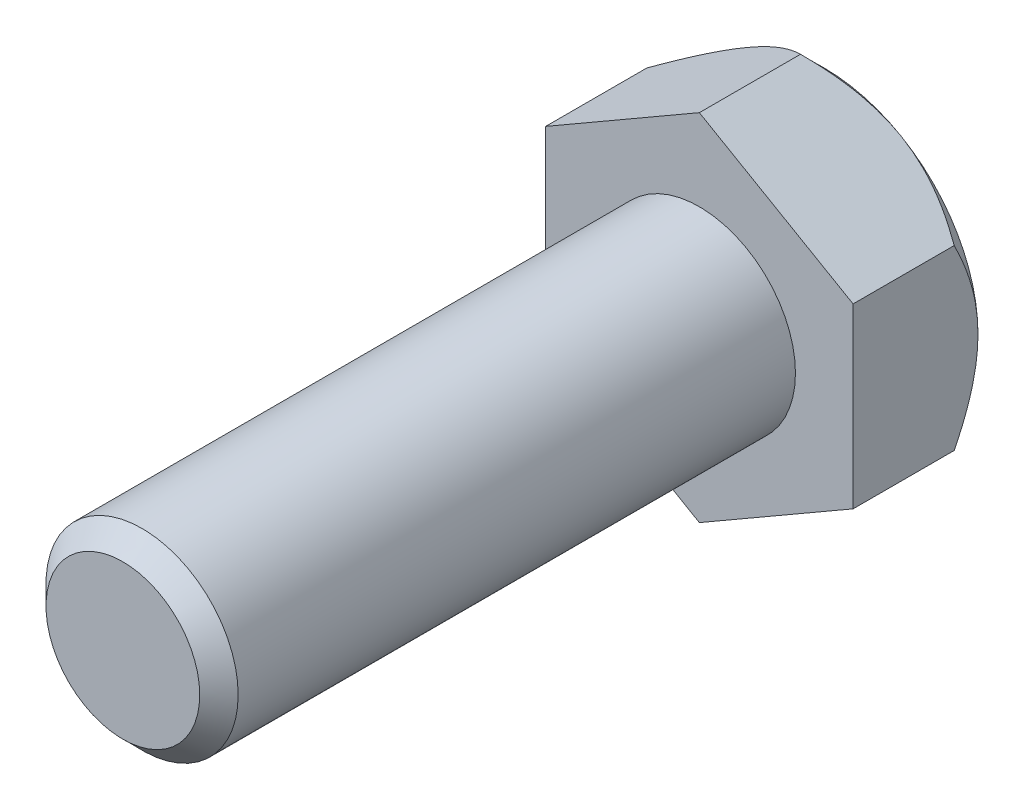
ISO-10303-21;
HEADER;
FILE_DESCRIPTION(('STEP AP214'),'2;1');
FILE_NAME('part.step','',(''),(''),'','','');
FILE_SCHEMA(('AUTOMOTIVE_DESIGN { 1 0 10303 214 1 1 1 1 }'));
ENDSEC;
DATA;
#1=APPLICATION_CONTEXT('core data for automotive mechanical design processes');
#2=APPLICATION_PROTOCOL_DEFINITION('international standard','automotive_design',2000,#1);
#3=PRODUCT_CONTEXT('',#1,'mechanical');
#4=PRODUCT('Part','Part','',(#3));
#5=PRODUCT_RELATED_PRODUCT_CATEGORY('part','',(#4));
#6=PRODUCT_DEFINITION_FORMATION('','',#4);
#7=PRODUCT_DEFINITION_CONTEXT('part definition',#1,'design');
#8=PRODUCT_DEFINITION('design','',#6,#7);
#9=PRODUCT_DEFINITION_SHAPE('','',#8);
#10=(LENGTH_UNIT() NAMED_UNIT(*) SI_UNIT(.MILLI.,.METRE.));
#11=(NAMED_UNIT(*) PLANE_ANGLE_UNIT() SI_UNIT($,.RADIAN.));
#12=(NAMED_UNIT(*) SI_UNIT($,.STERADIAN.) SOLID_ANGLE_UNIT());
#13=UNCERTAINTY_MEASURE_WITH_UNIT(LENGTH_MEASURE(1.E-05),#10,'distance_accuracy_value','');
#14=(GEOMETRIC_REPRESENTATION_CONTEXT(3) GLOBAL_UNCERTAINTY_ASSIGNED_CONTEXT((#13)) GLOBAL_UNIT_ASSIGNED_CONTEXT((#10,
#11,#12)) REPRESENTATION_CONTEXT('',''));
#15=CARTESIAN_POINT('',(0.,0.,0.));
#16=DIRECTION('',(0.,0.,1.));
#17=DIRECTION('',(1.,0.,0.));
#18=AXIS2_PLACEMENT_3D('',#15,#16,#17);
#19=CARTESIAN_POINT('',(16.,9.23760430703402,13.));
#20=DIRECTION('',(-0.5,-0.866025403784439,0.));
#21=DIRECTION('',(0.866025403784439,-0.5,0.));
#22=AXIS2_PLACEMENT_3D('',#19,#20,#21);
#23=PLANE('',#22);
#24=CARTESIAN_POINT('',(-0.000200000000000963,18.4753240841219,2.47532408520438));
#25=CARTESIAN_POINT('',(0.274873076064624,18.3165105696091,2.3165349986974));
#26=CARTESIAN_POINT('',(0.552100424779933,18.1564532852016,2.16259136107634));
#27=CARTESIAN_POINT('',(1.11119892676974,17.8336576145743,1.86593410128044));
#28=CARTESIAN_POINT('',(1.39307251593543,17.670917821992,1.7232266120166));
#29=CARTESIAN_POINT('',(1.96312819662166,17.3417960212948,1.4499764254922));
#30=CARTESIAN_POINT('',(2.25133716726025,17.1753984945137,1.31950805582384));
#31=CARTESIAN_POINT('',(2.83248894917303,16.8398703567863,1.07356977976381));
#32=CARTESIAN_POINT('',(3.12543102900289,16.6707401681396,0.95809758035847));
#33=CARTESIAN_POINT('',(3.71133791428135,16.332466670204,0.745804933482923));
#34=CARTESIAN_POINT('',(4.00423072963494,16.1633649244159,0.648721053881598));
#35=CARTESIAN_POINT('',(4.5941253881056,15.8227890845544,0.47296030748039));
#36=CARTESIAN_POINT('',(4.89112679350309,15.6513152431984,0.394281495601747));
#37=CARTESIAN_POINT('',(5.48795465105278,15.3067365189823,0.257308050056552));
#38=CARTESIAN_POINT('',(5.78777315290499,15.1336362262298,0.198967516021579));
#39=CARTESIAN_POINT('',(6.38996475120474,14.7859607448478,0.10396707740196));
#40=CARTESIAN_POINT('',(6.69233745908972,14.6113857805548,0.0673039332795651));
#41=CARTESIAN_POINT('',(7.21228047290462,14.3111965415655,0.0238844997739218));
#42=CARTESIAN_POINT('',(7.42951394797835,14.1857767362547,0.0115883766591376));
#43=CARTESIAN_POINT('',(7.86423667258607,13.9347894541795,-0.00119864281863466));
#44=CARTESIAN_POINT('',(8.08172590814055,13.8092219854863,-0.00169015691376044));
#45=CARTESIAN_POINT('',(8.51656302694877,13.5581686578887,0.00914657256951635));
#46=CARTESIAN_POINT('',(8.73391083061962,13.4326828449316,0.0204790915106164));
#47=CARTESIAN_POINT('',(9.16790379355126,13.1821168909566,0.0547844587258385));
#48=CARTESIAN_POINT('',(9.38454894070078,13.0570367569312,0.0777575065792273));
#49=CARTESIAN_POINT('',(10.033228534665,12.6825214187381,0.163733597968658));
#50=CARTESIAN_POINT('',(10.4636398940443,12.4340233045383,0.243783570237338));
#51=CARTESIAN_POINT('',(11.3169944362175,11.9413388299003,0.444965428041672));
#52=CARTESIAN_POINT('',(11.7399381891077,11.6971521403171,0.566094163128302));
#53=CARTESIAN_POINT('',(12.4907260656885,11.2636845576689,0.815279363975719));
#54=CARTESIAN_POINT('',(12.8202294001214,11.0734457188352,0.936780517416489));
#55=CARTESIAN_POINT('',(13.4733181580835,10.696384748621,1.19936105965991));
#56=CARTESIAN_POINT('',(13.7969034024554,10.5095627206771,1.34044104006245));
#57=CARTESIAN_POINT('',(14.4371411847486,10.1399212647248,1.6390166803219));
#58=CARTESIAN_POINT('',(14.7538119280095,9.95709132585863,1.79646071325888));
#59=CARTESIAN_POINT('',(15.3812901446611,9.59481660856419,2.12569791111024));
#60=CARTESIAN_POINT('',(15.692101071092,9.41536983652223,2.29748227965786));
#61=CARTESIAN_POINT('',(16.0002,9.23748883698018,2.47532408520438));
#62=B_SPLINE_CURVE_WITH_KNOTS('',3,(#24,#25,#26,#27,#28,#29,#30,#31,#32,#33,#34,#35,#36,#37,#38,
#39,#40,#41,#42,#43,#44,#45,#46,#47,#48,#49,#50,#51,#52,#53,#54,#55,#56,#57,#58,#59,#60,#61),
.UNSPECIFIED.,.F.,.F.,(4,2,2,2,2,2,2,2,2,2,2,2,2,2,2,2,2,2,4),(0.,1.06536581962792,
2.13130916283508,3.20335555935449,4.27523783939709,5.33035842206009,6.38536744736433,
7.43797982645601,8.49043486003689,9.2435992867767,9.99672430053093,10.7501217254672,
11.5035320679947,13.0116203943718,14.5195930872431,15.7172424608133,16.9149280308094,
18.108943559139,19.3022319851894),.UNSPECIFIED.);
#63=CARTESIAN_POINT('',(0.,18.475208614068,2.47520861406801));
#64=VERTEX_POINT('',#63);
#65=CARTESIAN_POINT('',(8.,13.856406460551,0.));
#66=VERTEX_POINT('',#65);
#67=EDGE_CURVE('E51',#64,#66,#62,.T.);
#68=ORIENTED_EDGE('',*,*,#67,.F.);
#69=DIRECTION('',(0.,0.,-1.));
#70=VECTOR('',#69,1.);
#71=CARTESIAN_POINT('',(0.,18.475208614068,13.));
#72=LINE('',#71,#70);
#73=CARTESIAN_POINT('',(0.,18.475208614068,13.));
#74=VERTEX_POINT('',#73);
#75=EDGE_CURVE('E148',#74,#64,#72,.T.);
#76=ORIENTED_EDGE('',*,*,#75,.F.);
#77=DIRECTION('',(-0.866025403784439,0.5,0.));
#78=VECTOR('',#77,1.);
#79=CARTESIAN_POINT('',(16.,9.23760430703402,13.));
#80=LINE('',#79,#78);
#81=CARTESIAN_POINT('',(16.,9.23760430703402,13.));
#82=VERTEX_POINT('',#81);
#83=EDGE_CURVE('E249',#82,#74,#80,.T.);
#84=ORIENTED_EDGE('',*,*,#83,.F.);
#85=DIRECTION('',(0.,0.,-1.));
#86=VECTOR('',#85,1.);
#87=CARTESIAN_POINT('',(16.,9.23760430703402,13.));
#88=LINE('',#87,#86);
#89=CARTESIAN_POINT('',(16.,9.23760430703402,2.47520861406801));
#90=VERTEX_POINT('',#89);
#91=EDGE_CURVE('E135',#82,#90,#88,.T.);
#92=ORIENTED_EDGE('',*,*,#91,.T.);
#93=EDGE_CURVE('E129',#66,#90,#62,.T.);
#94=ORIENTED_EDGE('',*,*,#93,.F.);
#95=EDGE_LOOP('',(#68,#76,#84,#92,#94));
#96=FACE_BOUND('',#95,.T.);
#97=ADVANCED_FACE('F35',(#96),#23,.F.);
#98=CARTESIAN_POINT('',(0.,18.475208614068,13.));
#99=DIRECTION('',(0.5,-0.866025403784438,0.));
#100=DIRECTION('',(0.866025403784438,0.5,0.));
#101=AXIS2_PLACEMENT_3D('',#98,#99,#100);
#102=PLANE('',#101);
#103=CARTESIAN_POINT('',(-16.0002,9.23748883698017,2.47532408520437));
#104=CARTESIAN_POINT('',(-15.7251269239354,9.39630235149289,2.31653499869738));
#105=CARTESIAN_POINT('',(-15.4478995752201,9.5563596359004,2.16259136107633));
#106=CARTESIAN_POINT('',(-14.8888010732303,9.87915530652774,1.86593410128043));
#107=CARTESIAN_POINT('',(-14.6069274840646,10.04189509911,1.72322661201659));
#108=CARTESIAN_POINT('',(-14.0368718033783,10.3710168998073,1.44997642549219));
#109=CARTESIAN_POINT('',(-13.7486628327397,10.5374144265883,1.31950805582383));
#110=CARTESIAN_POINT('',(-13.167511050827,10.8729425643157,1.0735697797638));
#111=CARTESIAN_POINT('',(-12.8745689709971,11.0420727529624,0.958097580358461));
#112=CARTESIAN_POINT('',(-12.2886620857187,11.380346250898,0.745804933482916));
#113=CARTESIAN_POINT('',(-11.9957692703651,11.5494479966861,0.64872105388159));
#114=CARTESIAN_POINT('',(-11.4058746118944,11.8900238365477,0.472960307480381));
#115=CARTESIAN_POINT('',(-11.1088732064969,12.0614976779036,0.394281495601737));
#116=CARTESIAN_POINT('',(-10.5120453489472,12.4060764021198,0.257308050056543));
#117=CARTESIAN_POINT('',(-10.212226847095,12.5791766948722,0.198967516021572));
#118=CARTESIAN_POINT('',(-9.61003524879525,12.9268521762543,0.103967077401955));
#119=CARTESIAN_POINT('',(-9.30766254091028,13.1014271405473,0.0673039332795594));
#120=CARTESIAN_POINT('',(-8.78771952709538,13.4016163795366,0.0238844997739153));
#121=CARTESIAN_POINT('',(-8.57048605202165,13.5270361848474,0.0115883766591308));
#122=CARTESIAN_POINT('',(-8.13576332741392,13.7780234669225,-0.00119864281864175));
#123=CARTESIAN_POINT('',(-7.91827409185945,13.9035909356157,-0.00169015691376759));
#124=CARTESIAN_POINT('',(-7.48343697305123,14.1546442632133,0.00914657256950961));
#125=CARTESIAN_POINT('',(-7.26608916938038,14.2801300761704,0.0204790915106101));
#126=CARTESIAN_POINT('',(-6.83209620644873,14.5306960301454,0.0547844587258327));
#127=CARTESIAN_POINT('',(-6.61545105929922,14.6557761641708,0.0777575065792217));
#128=CARTESIAN_POINT('',(-5.96677146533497,15.0302915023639,0.163733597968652));
#129=CARTESIAN_POINT('',(-5.53636010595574,15.2787896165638,0.243783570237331));
#130=CARTESIAN_POINT('',(-4.68300556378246,15.7714740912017,0.444965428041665));
#131=CARTESIAN_POINT('',(-4.26006181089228,16.0156607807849,0.566094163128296));
#132=CARTESIAN_POINT('',(-3.50927393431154,16.4491283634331,0.815279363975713));
#133=CARTESIAN_POINT('',(-3.17977059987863,16.6393672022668,0.936780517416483));
#134=CARTESIAN_POINT('',(-2.52668184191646,17.016428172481,1.19936105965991));
#135=CARTESIAN_POINT('',(-2.20309659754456,17.2032502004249,1.34044104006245));
#136=CARTESIAN_POINT('',(-1.56285881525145,17.5728916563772,1.6390166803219));
#137=CARTESIAN_POINT('',(-1.24618807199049,17.7557215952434,1.79646071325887));
#138=CARTESIAN_POINT('',(-0.618709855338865,18.1179963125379,2.12569791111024));
#139=CARTESIAN_POINT('',(-0.307898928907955,18.2974430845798,2.29748227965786));
#140=CARTESIAN_POINT('',(0.000200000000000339,18.4753240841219,2.47532408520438));
#141=B_SPLINE_CURVE_WITH_KNOTS('',3,(#103,#104,#105,#106,#107,#108,#109,#110,#111,#112,#113,
#114,#115,#116,#117,#118,#119,#120,#121,#122,#123,#124,#125,#126,#127,#128,#129,#130,#131,#132,
#133,#134,#135,#136,#137,#138,#139,#140),.UNSPECIFIED.,.F.,.F.,(4,2,2,2,2,2,2,2,2,2,2,2,2,2,2,2,
2,2,4),(0.,1.06536581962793,2.13130916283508,3.2033555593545,4.27523783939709,5.3303584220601,
6.38536744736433,7.43797982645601,8.4904348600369,9.24359928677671,9.99672430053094,
10.7501217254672,11.5035320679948,13.0116203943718,14.5195930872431,15.7172424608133,
16.9149280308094,18.108943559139,19.3022319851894),.UNSPECIFIED.);
#142=CARTESIAN_POINT('',(-16.,9.23760430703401,2.47520861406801));
#143=VERTEX_POINT('',#142);
#144=CARTESIAN_POINT('',(-8.00000000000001,13.856406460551,0.));
#145=VERTEX_POINT('',#144);
#146=EDGE_CURVE('E58',#143,#145,#141,.T.);
#147=ORIENTED_EDGE('',*,*,#146,.F.);
#148=DIRECTION('',(0.,0.,-1.));
#149=VECTOR('',#148,1.);
#150=CARTESIAN_POINT('',(-16.,9.23760430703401,13.));
#151=LINE('',#150,#149);
#152=CARTESIAN_POINT('',(-16.,9.23760430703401,13.));
#153=VERTEX_POINT('',#152);
#154=EDGE_CURVE('E145',#153,#143,#151,.T.);
#155=ORIENTED_EDGE('',*,*,#154,.F.);
#156=DIRECTION('',(-0.866025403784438,-0.5,0.));
#157=VECTOR('',#156,1.);
#158=CARTESIAN_POINT('',(0.,18.475208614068,13.));
#159=LINE('',#158,#157);
#160=EDGE_CURVE('E247',#74,#153,#159,.T.);
#161=ORIENTED_EDGE('',*,*,#160,.F.);
#162=ORIENTED_EDGE('',*,*,#75,.T.);
#163=EDGE_CURVE('E169',#145,#64,#141,.T.);
#164=ORIENTED_EDGE('',*,*,#163,.F.);
#165=EDGE_LOOP('',(#147,#155,#161,#162,#164));
#166=FACE_BOUND('',#165,.T.);
#167=ADVANCED_FACE('F176',(#166),#102,.F.);
#168=CARTESIAN_POINT('',(-16.,9.23760430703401,13.));
#169=DIRECTION('',(1.,0.,0.));
#170=DIRECTION('',(0.,1.,0.));
#171=AXIS2_PLACEMENT_3D('',#168,#169,#170);
#172=PLANE('',#171);
#173=CARTESIAN_POINT('',(-16.,-20.9426996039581,10.3552018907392));
#174=CARTESIAN_POINT('',(-16.,-20.6926064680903,10.1564729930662));
#175=CARTESIAN_POINT('',(-16.,-20.4418779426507,9.9585442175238));
#176=CARTESIAN_POINT('',(-16.,-19.9390378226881,9.56444441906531));
#177=CARTESIAN_POINT('',(-16.,-19.686926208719,9.36827342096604));
#178=CARTESIAN_POINT('',(-16.,-18.9282584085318,8.78256415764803));
#179=CARTESIAN_POINT('',(-16.,-18.4194685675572,8.39590872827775));
#180=CARTESIAN_POINT('',(-16.,-17.3910449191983,7.62901052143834));
#181=CARTESIAN_POINT('',(-16.,-16.8713581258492,7.24883865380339));
#182=CARTESIAN_POINT('',(-16.,-15.8237057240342,6.50011980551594));
#183=CARTESIAN_POINT('',(-16.,-15.2957406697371,6.13157205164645));
#184=CARTESIAN_POINT('',(-16.,-14.1895322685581,5.38141922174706));
#185=CARTESIAN_POINT('',(-16.,-13.6105159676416,5.00094861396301));
#186=CARTESIAN_POINT('',(-16.,-12.4388329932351,4.2612445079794));
#187=CARTESIAN_POINT('',(-16.,-11.8461638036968,3.90201496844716));
#188=CARTESIAN_POINT('',(-16.,-10.6466339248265,3.21225286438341));
#189=CARTESIAN_POINT('',(-16.,-10.0398214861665,2.88163693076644));
#190=CARTESIAN_POINT('',(-16.,-8.80796271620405,2.25646976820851));
#191=CARTESIAN_POINT('',(-16.,-8.18292578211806,1.96190034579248));
#192=CARTESIAN_POINT('',(-16.,-7.27098762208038,1.57284203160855));
#193=CARTESIAN_POINT('',(-16.,-6.99222005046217,1.4592164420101));
#194=CARTESIAN_POINT('',(-16.,-6.43080908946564,1.24204738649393));
#195=CARTESIAN_POINT('',(-16.,-6.1481657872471,1.13850369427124));
#196=CARTESIAN_POINT('',(-16.,-5.29426133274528,0.844699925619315));
#197=CARTESIAN_POINT('',(-16.,-4.71697423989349,0.671244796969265));
#198=CARTESIAN_POINT('',(-16.,-3.84719074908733,0.453698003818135));
#199=CARTESIAN_POINT('',(-16.,-3.55979484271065,0.388776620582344));
#200=CARTESIAN_POINT('',(-16.,-2.98218355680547,0.273089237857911));
#201=CARTESIAN_POINT('',(-16.,-2.69196868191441,0.222320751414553));
#202=CARTESIAN_POINT('',(-16.,-2.10933343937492,0.135869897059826));
#203=CARTESIAN_POINT('',(-16.,-1.81691336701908,0.100185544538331));
#204=CARTESIAN_POINT('',(-16.,-1.23057114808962,0.0445988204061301));
#205=CARTESIAN_POINT('',(-16.,-0.936649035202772,0.0246960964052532));
#206=CARTESIAN_POINT('',(-16.,-0.365997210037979,0.00180185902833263));
#207=CARTESIAN_POINT('',(-16.,-0.0893054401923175,-0.0021417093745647));
#208=CARTESIAN_POINT('',(-16.,0.463906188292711,0.00433422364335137));
#209=CARTESIAN_POINT('',(-16.,0.740426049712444,0.0147534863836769));
#210=CARTESIAN_POINT('',(-16.,1.29257694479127,0.0497611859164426));
#211=CARTESIAN_POINT('',(-16.,1.56820793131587,0.0743503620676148));
#212=CARTESIAN_POINT('',(-16.,2.11789448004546,0.137252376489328));
#213=CARTESIAN_POINT('',(-16.,2.3919500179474,0.175565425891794));
#214=CARTESIAN_POINT('',(-16.,2.94316448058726,0.26612719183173));
#215=CARTESIAN_POINT('',(-16.,3.22028154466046,0.318630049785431));
#216=CARTESIAN_POINT('',(-16.,3.7718139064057,0.436360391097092));
#217=CARTESIAN_POINT('',(-16.,4.04622881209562,0.501589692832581));
#218=CARTESIAN_POINT('',(-16.,4.86473786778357,0.714915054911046));
#219=CARTESIAN_POINT('',(-16.,5.40428452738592,0.880680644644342));
#220=CARTESIAN_POINT('',(-16.,6.47192398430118,1.25206491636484));
#221=CARTESIAN_POINT('',(-16.,6.99995405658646,1.45786018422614));
#222=CARTESIAN_POINT('',(-16.,8.04256648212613,1.90140202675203));
#223=CARTESIAN_POINT('',(-16.,8.55714291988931,2.13916238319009));
#224=CARTESIAN_POINT('',(-16.,9.57515450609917,2.64099813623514));
#225=CARTESIAN_POINT('',(-16.,10.0785505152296,2.90515222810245));
#226=CARTESIAN_POINT('',(-16.,11.0738527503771,3.45399484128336));
#227=CARTESIAN_POINT('',(-16.,11.5657606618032,3.7386803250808));
#228=CARTESIAN_POINT('',(-16.,12.5155261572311,4.3101398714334));
#229=CARTESIAN_POINT('',(-16.,12.9738658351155,4.59611693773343));
#230=CARTESIAN_POINT('',(-16.,13.8826699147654,5.18035386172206));
#231=CARTESIAN_POINT('',(-16.,14.3331337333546,5.4786146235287));
#232=CARTESIAN_POINT('',(-16.,15.2236360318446,6.08286643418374));
#233=CARTESIAN_POINT('',(-16.,15.6637287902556,6.3887776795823));
#234=CARTESIAN_POINT('',(-16.,16.3193680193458,6.85384205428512));
#235=CARTESIAN_POINT('',(-16.,16.5371369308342,7.00987611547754));
#236=CARTESIAN_POINT('',(-16.,16.9712874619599,7.32385355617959));
#237=CARTESIAN_POINT('',(-16.,17.1876691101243,7.48179689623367));
#238=CARTESIAN_POINT('',(-16.,17.4034082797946,7.6406137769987));
#239=B_SPLINE_CURVE_WITH_KNOTS('',3,(#173,#174,#175,#176,#177,#178,#179,#180,#181,#182,#183,
#184,#185,#186,#187,#188,#189,#190,#191,#192,#193,#194,#195,#196,#197,#198,#199,#200,#201,#202,
#203,#204,#205,#206,#207,#208,#209,#210,#211,#212,#213,#214,#215,#216,#217,#218,#219,#220,#221,
#222,#223,#224,#225,#226,#227,#228,#229,#230,#231,#232,#233,#234,#235,#236,#237,#238),
.UNSPECIFIED.,.F.,.F.,(4,2,2,2,2,2,2,2,2,2,2,2,2,2,2,2,2,2,2,2,2,2,2,2,2,2,2,2,2,2,2,2,4),(0.,
0.958306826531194,1.9166271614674,3.83364867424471,5.76521465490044,7.69665187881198,
9.77479256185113,11.8533193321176,13.9255704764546,15.9967713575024,16.8996995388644,
17.8026074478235,19.6082555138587,20.4918878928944,21.3753649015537,22.2587256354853,
23.1420666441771,23.9718573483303,24.8016342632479,25.6314544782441,26.4612874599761,
27.3070998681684,28.1530332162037,29.8443293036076,31.5432628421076,33.2429312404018,
34.9478278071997,36.652472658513,38.2729596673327,39.893566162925,41.5013542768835,
42.305043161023,43.1087154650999),.UNSPECIFIED.);
#240=CARTESIAN_POINT('',(-16.,-9.23760430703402,2.47520861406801));
#241=VERTEX_POINT('',#240);
#242=CARTESIAN_POINT('',(-16.,0.,0.));
#243=VERTEX_POINT('',#242);
#244=EDGE_CURVE('E251',#241,#243,#239,.T.);
#245=ORIENTED_EDGE('',*,*,#244,.F.);
#246=DIRECTION('',(0.,0.,-1.));
#247=VECTOR('',#246,1.);
#248=CARTESIAN_POINT('',(-16.,-9.23760430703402,13.));
#249=LINE('',#248,#247);
#250=CARTESIAN_POINT('',(-16.,-9.23760430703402,13.));
#251=VERTEX_POINT('',#250);
#252=EDGE_CURVE('E137',#251,#241,#249,.T.);
#253=ORIENTED_EDGE('',*,*,#252,.F.);
#254=DIRECTION('',(0.,-1.,0.));
#255=VECTOR('',#254,1.);
#256=CARTESIAN_POINT('',(-16.,9.23760430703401,13.));
#257=LINE('',#256,#255);
#258=EDGE_CURVE('E243',#153,#251,#257,.T.);
#259=ORIENTED_EDGE('',*,*,#258,.F.);
#260=ORIENTED_EDGE('',*,*,#154,.T.);
#261=EDGE_CURVE('E194',#243,#143,#239,.T.);
#262=ORIENTED_EDGE('',*,*,#261,.F.);
#263=EDGE_LOOP('',(#245,#253,#259,#260,#262));
#264=FACE_BOUND('',#263,.T.);
#265=ADVANCED_FACE('F231',(#264),#172,.F.);
#266=CARTESIAN_POINT('',(-16.,-9.23760430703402,13.));
#267=DIRECTION('',(0.5,0.866025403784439,0.));
#268=DIRECTION('',(-0.866025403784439,0.5,0.));
#269=AXIS2_PLACEMENT_3D('',#266,#267,#268);
#270=PLANE('',#269);
#271=CARTESIAN_POINT('',(0.000200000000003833,-18.4753240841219,2.47532408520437));
#272=CARTESIAN_POINT('',(-0.274873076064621,-18.3165105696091,2.31653499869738));
#273=CARTESIAN_POINT('',(-0.55210042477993,-18.1564532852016,2.16259136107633));
#274=CARTESIAN_POINT('',(-1.11119892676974,-17.8336576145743,1.86593410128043));
#275=CARTESIAN_POINT('',(-1.39307251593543,-17.670917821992,1.72322661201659));
#276=CARTESIAN_POINT('',(-1.96312819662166,-17.3417960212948,1.44997642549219));
#277=CARTESIAN_POINT('',(-2.25133716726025,-17.1753984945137,1.31950805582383));
#278=CARTESIAN_POINT('',(-2.83248894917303,-16.8398703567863,1.0735697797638));
#279=CARTESIAN_POINT('',(-3.12543102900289,-16.6707401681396,0.958097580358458));
#280=CARTESIAN_POINT('',(-3.71133791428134,-16.332466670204,0.745804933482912));
#281=CARTESIAN_POINT('',(-4.00423072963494,-16.1633649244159,0.648721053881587));
#282=CARTESIAN_POINT('',(-4.5941253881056,-15.8227890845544,0.47296030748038));
#283=CARTESIAN_POINT('',(-4.89112679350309,-15.6513152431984,0.394281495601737));
#284=CARTESIAN_POINT('',(-5.48795465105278,-15.3067365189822,0.257308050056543));
#285=CARTESIAN_POINT('',(-5.78777315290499,-15.1336362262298,0.19896751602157));
#286=CARTESIAN_POINT('',(-6.38996475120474,-14.7859607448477,0.103967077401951));
#287=CARTESIAN_POINT('',(-6.69233745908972,-14.6113857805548,0.0673039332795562));
#288=CARTESIAN_POINT('',(-7.21228047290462,-14.3111965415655,0.0238844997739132));
#289=CARTESIAN_POINT('',(-7.42951394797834,-14.1857767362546,0.0115883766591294));
#290=CARTESIAN_POINT('',(-7.86423667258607,-13.9347894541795,-0.00119864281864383));
#291=CARTESIAN_POINT('',(-8.08172590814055,-13.8092219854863,-0.00169015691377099));
#292=CARTESIAN_POINT('',(-8.51656302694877,-13.5581686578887,0.0091465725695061));
#293=CARTESIAN_POINT('',(-8.73391083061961,-13.4326828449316,0.0204790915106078));
#294=CARTESIAN_POINT('',(-9.16790379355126,-13.1821168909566,0.0547844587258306));
#295=CARTESIAN_POINT('',(-9.38454894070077,-13.0570367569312,0.0777575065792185));
#296=CARTESIAN_POINT('',(-10.033228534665,-12.6825214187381,0.163733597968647));
#297=CARTESIAN_POINT('',(-10.4636398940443,-12.4340233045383,0.243783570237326));
#298=CARTESIAN_POINT('',(-11.3169944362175,-11.9413388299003,0.444965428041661));
#299=CARTESIAN_POINT('',(-11.7399381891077,-11.6971521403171,0.566094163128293));
#300=CARTESIAN_POINT('',(-12.4907260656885,-11.2636845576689,0.815279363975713));
#301=CARTESIAN_POINT('',(-12.8202294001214,-11.0734457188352,0.936780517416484));
#302=CARTESIAN_POINT('',(-13.4733181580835,-10.696384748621,1.19936105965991));
#303=CARTESIAN_POINT('',(-13.7969034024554,-10.5095627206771,1.34044104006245));
#304=CARTESIAN_POINT('',(-14.4371411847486,-10.1399212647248,1.6390166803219));
#305=CARTESIAN_POINT('',(-14.7538119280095,-9.95709132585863,1.79646071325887));
#306=CARTESIAN_POINT('',(-15.3812901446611,-9.59481660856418,2.12569791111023));
#307=CARTESIAN_POINT('',(-15.692101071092,-9.41536983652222,2.29748227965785));
#308=CARTESIAN_POINT('',(-16.0002,-9.23748883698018,2.47532408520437));
#309=B_SPLINE_CURVE_WITH_KNOTS('',3,(#271,#272,#273,#274,#275,#276,#277,#278,#279,#280,#281,
#282,#283,#284,#285,#286,#287,#288,#289,#290,#291,#292,#293,#294,#295,#296,#297,#298,#299,#300,
#301,#302,#303,#304,#305,#306,#307,#308),.UNSPECIFIED.,.F.,.F.,(4,2,2,2,2,2,2,2,2,2,2,2,2,2,2,2,
2,2,4),(0.,1.06536581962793,2.13130916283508,3.2033555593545,4.27523783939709,5.3303584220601,
6.38536744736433,7.43797982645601,8.49043486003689,9.2435992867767,9.99672430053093,
10.7501217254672,11.5035320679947,13.0116203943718,14.5195930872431,15.7172424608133,
16.9149280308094,18.108943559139,19.3022319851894),.UNSPECIFIED.);
#310=CARTESIAN_POINT('',(0.,-18.475208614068,2.47520861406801));
#311=VERTEX_POINT('',#310);
#312=CARTESIAN_POINT('',(-8.,-13.856406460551,0.));
#313=VERTEX_POINT('',#312);
#314=EDGE_CURVE('E179',#311,#313,#309,.T.);
#315=ORIENTED_EDGE('',*,*,#314,.F.);
#316=DIRECTION('',(0.,0.,-1.));
#317=VECTOR('',#316,1.);
#318=CARTESIAN_POINT('',(0.,-18.475208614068,13.));
#319=LINE('',#318,#317);
#320=CARTESIAN_POINT('',(0.,-18.475208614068,13.));
#321=VERTEX_POINT('',#320);
#322=EDGE_CURVE('E134',#321,#311,#319,.T.);
#323=ORIENTED_EDGE('',*,*,#322,.F.);
#324=DIRECTION('',(0.866025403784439,-0.5,0.));
#325=VECTOR('',#324,1.);
#326=CARTESIAN_POINT('',(-16.,-9.23760430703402,13.));
#327=LINE('',#326,#325);
#328=EDGE_CURVE('E241',#251,#321,#327,.T.);
#329=ORIENTED_EDGE('',*,*,#328,.F.);
#330=ORIENTED_EDGE('',*,*,#252,.T.);
#331=EDGE_CURVE('E181',#313,#241,#309,.T.);
#332=ORIENTED_EDGE('',*,*,#331,.F.);
#333=EDGE_LOOP('',(#315,#323,#329,#330,#332));
#334=FACE_BOUND('',#333,.T.);
#335=ADVANCED_FACE('F237',(#334),#270,.F.);
#336=CARTESIAN_POINT('',(0.,-18.475208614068,13.));
#337=DIRECTION('',(-0.5,0.866025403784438,0.));
#338=DIRECTION('',(-0.866025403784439,-0.5,0.));
#339=AXIS2_PLACEMENT_3D('',#336,#337,#338);
#340=PLANE('',#339);
#341=CARTESIAN_POINT('',(16.0002,-9.23748883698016,2.47532408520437));
#342=CARTESIAN_POINT('',(15.7251269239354,-9.39630235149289,2.31653499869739));
#343=CARTESIAN_POINT('',(15.4478995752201,-9.5563596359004,2.16259136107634));
#344=CARTESIAN_POINT('',(14.8888010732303,-9.87915530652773,1.86593410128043));
#345=CARTESIAN_POINT('',(14.6069274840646,-10.04189509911,1.7232266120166));
#346=CARTESIAN_POINT('',(14.0368718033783,-10.3710168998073,1.44997642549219));
#347=CARTESIAN_POINT('',(13.7486628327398,-10.5374144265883,1.31950805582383));
#348=CARTESIAN_POINT('',(13.167511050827,-10.8729425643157,1.0735697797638));
#349=CARTESIAN_POINT('',(12.8745689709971,-11.0420727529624,0.958097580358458));
#350=CARTESIAN_POINT('',(12.2886620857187,-11.380346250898,0.745804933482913));
#351=CARTESIAN_POINT('',(11.9957692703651,-11.5494479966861,0.648721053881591));
#352=CARTESIAN_POINT('',(11.4058746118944,-11.8900238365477,0.472960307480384));
#353=CARTESIAN_POINT('',(11.1088732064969,-12.0614976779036,0.394281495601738));
#354=CARTESIAN_POINT('',(10.5120453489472,-12.4060764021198,0.25730805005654));
#355=CARTESIAN_POINT('',(10.212226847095,-12.5791766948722,0.198967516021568));
#356=CARTESIAN_POINT('',(9.61003524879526,-12.9268521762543,0.103967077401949));
#357=CARTESIAN_POINT('',(9.30766254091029,-13.1014271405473,0.0673039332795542));
#358=CARTESIAN_POINT('',(8.78771952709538,-13.4016163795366,0.0238844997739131));
#359=CARTESIAN_POINT('',(8.57048605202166,-13.5270361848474,0.0115883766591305));
#360=CARTESIAN_POINT('',(8.13576332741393,-13.7780234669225,-0.00119864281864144));
#361=CARTESIAN_POINT('',(7.91827409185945,-13.9035909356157,-0.00169015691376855));
#362=CARTESIAN_POINT('',(7.48343697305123,-14.1546442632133,0.00914657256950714));
#363=CARTESIAN_POINT('',(7.26608916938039,-14.2801300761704,0.0204790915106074));
#364=CARTESIAN_POINT('',(6.83209620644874,-14.5306960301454,0.05478445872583));
#365=CARTESIAN_POINT('',(6.61545105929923,-14.6557761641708,0.0777575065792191));
#366=CARTESIAN_POINT('',(5.96677146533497,-15.0302915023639,0.163733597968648));
#367=CARTESIAN_POINT('',(5.53636010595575,-15.2787896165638,0.243783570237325));
#368=CARTESIAN_POINT('',(4.68300556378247,-15.7714740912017,0.444965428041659));
#369=CARTESIAN_POINT('',(4.26006181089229,-16.0156607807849,0.566094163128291));
#370=CARTESIAN_POINT('',(3.50927393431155,-16.4491283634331,0.815279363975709));
#371=CARTESIAN_POINT('',(3.17977059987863,-16.6393672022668,0.936780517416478));
#372=CARTESIAN_POINT('',(2.52668184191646,-17.016428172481,1.1993610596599));
#373=CARTESIAN_POINT('',(2.20309659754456,-17.2032502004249,1.34044104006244));
#374=CARTESIAN_POINT('',(1.56285881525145,-17.5728916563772,1.6390166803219));
#375=CARTESIAN_POINT('',(1.2461880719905,-17.7557215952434,1.79646071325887));
#376=CARTESIAN_POINT('',(0.618709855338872,-18.1179963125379,2.12569791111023));
#377=CARTESIAN_POINT('',(0.307898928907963,-18.2974430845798,2.29748227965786));
#378=CARTESIAN_POINT('',(-0.000199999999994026,-18.4753240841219,2.47532408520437));
#379=B_SPLINE_CURVE_WITH_KNOTS('',3,(#341,#342,#343,#344,#345,#346,#347,#348,#349,#350,#351,
#352,#353,#354,#355,#356,#357,#358,#359,#360,#361,#362,#363,#364,#365,#366,#367,#368,#369,#370,
#371,#372,#373,#374,#375,#376,#377,#378),.UNSPECIFIED.,.F.,.F.,(4,2,2,2,2,2,2,2,2,2,2,2,2,2,2,2,
2,2,4),(0.,1.06536581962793,2.13130916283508,3.20335555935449,4.27523783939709,5.3303584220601,
6.38536744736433,7.43797982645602,8.4904348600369,9.24359928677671,9.99672430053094,
10.7501217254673,11.5035320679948,13.0116203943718,14.5195930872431,15.7172424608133,
16.9149280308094,18.108943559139,19.3022319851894),.UNSPECIFIED.);
#380=CARTESIAN_POINT('',(16.,-9.237604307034,2.47520861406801));
#381=VERTEX_POINT('',#380);
#382=CARTESIAN_POINT('',(8.00000000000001,-13.856406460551,0.));
#383=VERTEX_POINT('',#382);
#384=EDGE_CURVE('E111',#381,#383,#379,.T.);
#385=ORIENTED_EDGE('',*,*,#384,.F.);
#386=DIRECTION('',(0.,0.,-1.));
#387=VECTOR('',#386,1.);
#388=CARTESIAN_POINT('',(16.,-9.237604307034,13.));
#389=LINE('',#388,#387);
#390=CARTESIAN_POINT('',(16.,-9.237604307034,13.));
#391=VERTEX_POINT('',#390);
#392=EDGE_CURVE('E125',#391,#381,#389,.T.);
#393=ORIENTED_EDGE('',*,*,#392,.F.);
#394=DIRECTION('',(0.866025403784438,0.5,0.));
#395=VECTOR('',#394,1.);
#396=CARTESIAN_POINT('',(0.,-18.475208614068,13.));
#397=LINE('',#396,#395);
#398=EDGE_CURVE('E239',#321,#391,#397,.T.);
#399=ORIENTED_EDGE('',*,*,#398,.F.);
#400=ORIENTED_EDGE('',*,*,#322,.T.);
#401=EDGE_CURVE('E128',#383,#311,#379,.T.);
#402=ORIENTED_EDGE('',*,*,#401,.F.);
#403=EDGE_LOOP('',(#385,#393,#399,#400,#402));
#404=FACE_BOUND('',#403,.T.);
#405=ADVANCED_FACE('F123',(#404),#340,.F.);
#406=CARTESIAN_POINT('',(16.,-9.237604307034,13.));
#407=DIRECTION('',(-1.,0.,0.));
#408=DIRECTION('',(0.,-1.,0.));
#409=AXIS2_PLACEMENT_3D('',#406,#407,#408);
#410=PLANE('',#409);
#411=CARTESIAN_POINT('',(16.,-20.9426996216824,10.3552019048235));
#412=CARTESIAN_POINT('',(16.,-20.6926064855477,10.1564730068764));
#413=CARTESIAN_POINT('',(16.,-20.4418779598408,9.95854423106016));
#414=CARTESIAN_POINT('',(16.,-19.9390378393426,9.56444443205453));
#415=CARTESIAN_POINT('',(16.,-19.6869262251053,9.36827343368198));
#416=CARTESIAN_POINT('',(16.,-18.9282584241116,8.78256416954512));
#417=CARTESIAN_POINT('',(16.,-18.4194685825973,8.3959087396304));
#418=CARTESIAN_POINT('',(16.,-17.3910449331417,7.62901053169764));
#419=CARTESIAN_POINT('',(16.,-16.8713581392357,7.24883866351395));
#420=CARTESIAN_POINT('',(16.,-15.8237057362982,6.50011981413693));
#421=CARTESIAN_POINT('',(16.,-15.2957406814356,6.13157205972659));
#422=CARTESIAN_POINT('',(16.,-14.189532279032,5.38141922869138));
#423=CARTESIAN_POINT('',(16.,-13.6105159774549,5.00094862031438));
#424=CARTESIAN_POINT('',(16.,-12.4388330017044,4.26124451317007));
#425=CARTESIAN_POINT('',(16.,-11.8461638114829,3.90201497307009));
#426=CARTESIAN_POINT('',(16.,-10.6466339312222,3.21225286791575));
#427=CARTESIAN_POINT('',(16.,-10.0398214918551,2.88163693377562));
#428=CARTESIAN_POINT('',(16.,-8.80796272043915,2.25646977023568));
#429=CARTESIAN_POINT('',(16.,-8.18292578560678,1.96190034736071));
#430=CARTESIAN_POINT('',(16.,-7.27098762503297,1.5728420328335));
#431=CARTESIAN_POINT('',(16.,-6.99222005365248,1.45921644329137));
#432=CARTESIAN_POINT('',(16.,-6.4308090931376,1.24204738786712));
#433=CARTESIAN_POINT('',(16.,-6.14816579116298,1.13850369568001));
#434=CARTESIAN_POINT('',(16.,-5.2942613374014,0.844699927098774));
#435=CARTESIAN_POINT('',(16.,-4.7169742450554,0.67124479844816));
#436=CARTESIAN_POINT('',(16.,-3.84719075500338,0.453698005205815));
#437=CARTESIAN_POINT('',(16.,-3.55979484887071,0.388776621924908));
#438=CARTESIAN_POINT('',(16.,-2.98218356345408,0.27308923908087));
#439=CARTESIAN_POINT('',(16.,-2.69196868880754,0.222320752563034));
#440=CARTESIAN_POINT('',(16.,-2.10933344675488,0.135869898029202));
#441=CARTESIAN_POINT('',(16.,-1.81691337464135,0.100185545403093));
#442=CARTESIAN_POINT('',(16.,-1.23057115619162,0.0445988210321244));
#443=CARTESIAN_POINT('',(16.,-0.936649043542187,0.0246960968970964));
#444=CARTESIAN_POINT('',(16.,-0.365997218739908,0.00180185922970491));
#445=CARTESIAN_POINT('',(16.,-0.0893054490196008,-0.00214170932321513));
#446=CARTESIAN_POINT('',(16.,0.463906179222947,0.00433422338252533));
#447=CARTESIAN_POINT('',(16.,0.740426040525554,0.0147534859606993));
#448=CARTESIAN_POINT('',(16.,1.29257693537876,0.0497611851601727));
#449=CARTESIAN_POINT('',(16.,1.56820792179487,0.0743503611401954));
#450=CARTESIAN_POINT('',(16.,2.11789447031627,0.137252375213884));
#451=CARTESIAN_POINT('',(16.,2.3919500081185,0.175565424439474));
#452=CARTESIAN_POINT('',(16.,2.94316447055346,0.266127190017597));
#453=CARTESIAN_POINT('',(16.,3.22028153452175,0.318630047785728));
#454=CARTESIAN_POINT('',(16.,3.77181389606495,0.436360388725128));
#455=CARTESIAN_POINT('',(16.,4.04622880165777,0.501589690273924));
#456=CARTESIAN_POINT('',(16.,4.86473785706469,0.71491505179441));
#457=CARTESIAN_POINT('',(16.,5.40428451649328,0.880680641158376));
#458=CARTESIAN_POINT('',(16.,6.47192397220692,1.25206491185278));
#459=CARTESIAN_POINT('',(16.,6.99995404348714,1.45786017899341));
#460=CARTESIAN_POINT('',(16.,8.04256646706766,1.90140202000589));
#461=CARTESIAN_POINT('',(16.,8.55714290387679,2.13916237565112));
#462=CARTESIAN_POINT('',(16.,9.57515448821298,2.64099812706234));
#463=CARTESIAN_POINT('',(16.,10.078550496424,2.90515221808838));
#464=CARTESIAN_POINT('',(16.,11.0738527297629,3.45399482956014));
#465=CARTESIAN_POINT('',(16.,11.5657606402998,3.7386803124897));
#466=CARTESIAN_POINT('',(16.,12.5155261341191,4.31013985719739));
#467=CARTESIAN_POINT('',(16.,12.973865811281,4.5961169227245));
#468=CARTESIAN_POINT('',(16.,13.8826698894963,5.18035384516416));
#469=CARTESIAN_POINT('',(16.,14.3331337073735,5.47861460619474));
#470=CARTESIAN_POINT('',(16.,15.2236360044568,6.0828664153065));
#471=CARTESIAN_POINT('',(16.,15.663728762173,6.38877765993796));
#472=CARTESIAN_POINT('',(16.,16.3193679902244,6.85384203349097));
#473=CARTESIAN_POINT('',(16.,16.5371369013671,7.00987609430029));
#474=CARTESIAN_POINT('',(16.,16.9712874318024,7.32385353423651));
#475=CARTESIAN_POINT('',(16.,17.187669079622,7.48179687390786));
#476=CARTESIAN_POINT('',(16.,17.4034082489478,7.64061375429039));
#477=B_SPLINE_CURVE_WITH_KNOTS('',3,(#411,#412,#413,#414,#415,#416,#417,#418,#419,#420,#421,
#422,#423,#424,#425,#426,#427,#428,#429,#430,#431,#432,#433,#434,#435,#436,#437,#438,#439,#440,
#441,#442,#443,#444,#445,#446,#447,#448,#449,#450,#451,#452,#453,#454,#455,#456,#457,#458,#459,
#460,#461,#462,#463,#464,#465,#466,#467,#468,#469,#470,#471,#472,#473,#474,#475,#476),
.UNSPECIFIED.,.F.,.F.,(4,2,2,2,2,2,2,2,2,2,2,2,2,2,2,2,2,2,2,2,2,2,2,2,2,2,2,2,2,2,2,2,4),(0.,
0.958306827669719,1.91662716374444,3.83364867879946,5.76521466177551,7.69665188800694,
9.77479257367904,11.8533193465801,13.9255704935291,15.9967713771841,16.8996995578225,
17.8026074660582,19.6082555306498,20.4918879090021,21.3753649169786,22.2587256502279,
23.1420666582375,23.9718573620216,24.8016342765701,25.6314544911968,26.4612874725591,
27.3070998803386,28.1530332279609,29.8443293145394,31.5432628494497,33.24293124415,
34.9478278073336,36.6524726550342,38.2729596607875,39.8935661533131,41.5013542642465,
42.3050431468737,43.1087154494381),.UNSPECIFIED.);
#478=CARTESIAN_POINT('',(16.,0.,0.));
#479=VERTEX_POINT('',#478);
#480=EDGE_CURVE('E117',#90,#479,#477,.F.);
#481=ORIENTED_EDGE('',*,*,#480,.F.);
#482=ORIENTED_EDGE('',*,*,#91,.F.);
#483=DIRECTION('',(0.,1.,0.));
#484=VECTOR('',#483,1.);
#485=CARTESIAN_POINT('',(16.,-9.237604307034,13.));
#486=LINE('',#485,#484);
#487=EDGE_CURVE('E133',#391,#82,#486,.T.);
#488=ORIENTED_EDGE('',*,*,#487,.F.);
#489=ORIENTED_EDGE('',*,*,#392,.T.);
#490=EDGE_CURVE('E108',#479,#381,#477,.F.);
#491=ORIENTED_EDGE('',*,*,#490,.F.);
#492=EDGE_LOOP('',(#481,#482,#488,#489,#491));
#493=FACE_BOUND('',#492,.T.);
#494=ADVANCED_FACE('F131',(#493),#410,.F.);
#495=CARTESIAN_POINT('',(0.,0.,13.));
#496=DIRECTION('',(0.,0.,1.));
#497=DIRECTION('',(1.,0.,0.));
#498=AXIS2_PLACEMENT_3D('',#495,#496,#497);
#499=PLANE('',#498);
#500=CARTESIAN_POINT('',(0.,0.,13.));
#501=DIRECTION('',(0.,0.,1.));
#502=DIRECTION('',(1.,0.,0.));
#503=AXIS2_PLACEMENT_3D('',#500,#501,#502);
#504=CIRCLE('',#503,10.);
#505=CARTESIAN_POINT('',(10.,0.,13.));
#506=VERTEX_POINT('',#505);
#507=EDGE_CURVE('E151',#506,#506,#504,.T.);
#508=ORIENTED_EDGE('',*,*,#507,.F.);
#509=EDGE_LOOP('',(#508));
#510=FACE_BOUND('',#509,.T.);
#511=ORIENTED_EDGE('',*,*,#83,.T.);
#512=ORIENTED_EDGE('',*,*,#160,.T.);
#513=ORIENTED_EDGE('',*,*,#258,.T.);
#514=ORIENTED_EDGE('',*,*,#328,.T.);
#515=ORIENTED_EDGE('',*,*,#398,.T.);
#516=ORIENTED_EDGE('',*,*,#487,.T.);
#517=EDGE_LOOP('',(#511,#512,#513,#514,#515,#516));
#518=FACE_BOUND('',#517,.T.);
#519=ADVANCED_FACE('F257',(#510,#518),#499,.T.);
#520=CARTESIAN_POINT('',(0.,0.,73.));
#521=DIRECTION('',(0.,0.,-1.));
#522=DIRECTION('',(-1.,0.,0.));
#523=AXIS2_PLACEMENT_3D('',#520,#521,#522);
#524=CYLINDRICAL_SURFACE('',#523,10.);
#525=CARTESIAN_POINT('',(0.,0.,71.));
#526=DIRECTION('',(0.,0.,1.));
#527=DIRECTION('',(1.,0.,0.));
#528=AXIS2_PLACEMENT_3D('',#525,#526,#527);
#529=CIRCLE('',#528,10.);
#530=CARTESIAN_POINT('',(10.,0.,71.));
#531=VERTEX_POINT('',#530);
#532=EDGE_CURVE('E154',#531,#531,#529,.F.);
#533=ORIENTED_EDGE('',*,*,#532,.T.);
#534=EDGE_LOOP('',(#533));
#535=FACE_BOUND('',#534,.T.);
#536=ORIENTED_EDGE('',*,*,#507,.T.);
#537=EDGE_LOOP('',(#536));
#538=FACE_BOUND('',#537,.T.);
#539=ADVANCED_FACE('F255',(#535,#538),#524,.T.);
#540=CARTESIAN_POINT('',(0.,0.,73.));
#541=DIRECTION('',(0.,0.,1.));
#542=DIRECTION('',(1.,0.,0.));
#543=AXIS2_PLACEMENT_3D('',#540,#541,#542);
#544=PLANE('',#543);
#545=CARTESIAN_POINT('',(0.,0.,73.));
#546=DIRECTION('',(0.,0.,1.));
#547=DIRECTION('',(1.,0.,0.));
#548=AXIS2_PLACEMENT_3D('',#545,#546,#547);
#549=CIRCLE('',#548,7.99999999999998);
#550=CARTESIAN_POINT('',(7.99999999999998,0.,73.));
#551=VERTEX_POINT('',#550);
#552=EDGE_CURVE('E152',#551,#551,#549,.T.);
#553=ORIENTED_EDGE('',*,*,#552,.T.);
#554=EDGE_LOOP('',(#553));
#555=FACE_BOUND('',#554,.T.);
#556=ADVANCED_FACE('F207',(#555),#544,.T.);
#557=CARTESIAN_POINT('',(0.,0.,73.));
#558=DIRECTION('',(0.,0.,-1.));
#559=DIRECTION('',(-1.,0.,0.));
#560=AXIS2_PLACEMENT_3D('',#557,#558,#559);
#561=CONICAL_SURFACE('',#560,7.99999999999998,0.785398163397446);
#562=ORIENTED_EDGE('',*,*,#532,.F.);
#563=EDGE_LOOP('',(#562));
#564=FACE_BOUND('',#563,.T.);
#565=ORIENTED_EDGE('',*,*,#552,.F.);
#566=EDGE_LOOP('',(#565));
#567=FACE_BOUND('',#566,.T.);
#568=ADVANCED_FACE('F37',(#564,#567),#561,.T.);
#569=CARTESIAN_POINT('',(0.,0.,0.));
#570=DIRECTION('',(0.,0.,1.));
#571=DIRECTION('',(-1.,0.,0.));
#572=AXIS2_PLACEMENT_3D('',#569,#570,#571);
#573=CONICAL_SURFACE('',#572,16.,0.78539816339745);
#574=ORIENTED_EDGE('',*,*,#384,.T.);
#575=CARTESIAN_POINT('',(0.,0.,0.));
#576=DIRECTION('',(0.,0.,1.));
#577=DIRECTION('',(1.,0.,0.));
#578=AXIS2_PLACEMENT_3D('',#575,#576,#577);
#579=CIRCLE('',#578,16.);
#580=EDGE_CURVE('E39',#383,#479,#579,.T.);
#581=ORIENTED_EDGE('',*,*,#580,.T.);
#582=ORIENTED_EDGE('',*,*,#490,.T.);
#583=EDGE_LOOP('',(#574,#581,#582));
#584=FACE_BOUND('',#583,.T.);
#585=ADVANCED_FACE('F110',(#584),#573,.T.);
#586=ORIENTED_EDGE('',*,*,#314,.T.);
#587=EDGE_CURVE('E158',#313,#383,#579,.T.);
#588=ORIENTED_EDGE('',*,*,#587,.T.);
#589=ORIENTED_EDGE('',*,*,#401,.T.);
#590=EDGE_LOOP('',(#586,#588,#589));
#591=FACE_BOUND('',#590,.T.);
#592=ADVANCED_FACE('F206',(#591),#573,.T.);
#593=ORIENTED_EDGE('',*,*,#244,.T.);
#594=EDGE_CURVE('E159',#243,#313,#579,.T.);
#595=ORIENTED_EDGE('',*,*,#594,.T.);
#596=ORIENTED_EDGE('',*,*,#331,.T.);
#597=EDGE_LOOP('',(#593,#595,#596));
#598=FACE_BOUND('',#597,.T.);
#599=ADVANCED_FACE('F201',(#598),#573,.T.);
#600=ORIENTED_EDGE('',*,*,#261,.T.);
#601=ORIENTED_EDGE('',*,*,#146,.T.);
#602=CARTESIAN_POINT('',(0.,0.,0.));
#603=DIRECTION('',(0.,0.,-1.));
#604=DIRECTION('',(-1.,0.,0.));
#605=AXIS2_PLACEMENT_3D('',#602,#603,#604);
#606=CIRCLE('',#605,16.);
#607=EDGE_CURVE('E118',#243,#145,#606,.T.);
#608=ORIENTED_EDGE('',*,*,#607,.F.);
#609=EDGE_LOOP('',(#600,#601,#608));
#610=FACE_BOUND('',#609,.T.);
#611=ADVANCED_FACE('F205',(#610),#573,.T.);
#612=ORIENTED_EDGE('',*,*,#163,.T.);
#613=ORIENTED_EDGE('',*,*,#67,.T.);
#614=EDGE_CURVE('E44',#66,#145,#579,.T.);
#615=ORIENTED_EDGE('',*,*,#614,.T.);
#616=EDGE_LOOP('',(#612,#613,#615));
#617=FACE_BOUND('',#616,.T.);
#618=ADVANCED_FACE('F167',(#617),#573,.T.);
#619=ORIENTED_EDGE('',*,*,#93,.T.);
#620=ORIENTED_EDGE('',*,*,#480,.T.);
#621=EDGE_CURVE('E12',#479,#66,#579,.T.);
#622=ORIENTED_EDGE('',*,*,#621,.T.);
#623=EDGE_LOOP('',(#619,#620,#622));
#624=FACE_BOUND('',#623,.T.);
#625=ADVANCED_FACE('F261',(#624),#573,.T.);
#626=CARTESIAN_POINT('',(0.,0.,0.));
#627=DIRECTION('',(0.,0.,1.));
#628=DIRECTION('',(1.,0.,0.));
#629=AXIS2_PLACEMENT_3D('',#626,#627,#628);
#630=PLANE('',#629);
#631=ORIENTED_EDGE('',*,*,#621,.F.);
#632=ORIENTED_EDGE('',*,*,#580,.F.);
#633=ORIENTED_EDGE('',*,*,#587,.F.);
#634=ORIENTED_EDGE('',*,*,#594,.F.);
#635=ORIENTED_EDGE('',*,*,#607,.T.);
#636=ORIENTED_EDGE('',*,*,#614,.F.);
#637=EDGE_LOOP('',(#631,#632,#633,#634,#635,#636));
#638=FACE_BOUND('',#637,.T.);
#639=ADVANCED_FACE('F172',(#638),#630,.F.);
#640=CLOSED_SHELL('',(#97,#167,#265,#335,#405,#494,#519,#539,#556,#568,#585,#592,#599,#611,#618,
#625,#639));
#641=MANIFOLD_SOLID_BREP('B2',#640);
#642=ADVANCED_BREP_SHAPE_REPRESENTATION('',(#18,#641),#14);
#643=SHAPE_DEFINITION_REPRESENTATION(#9,#642);
ENDSEC;
END-ISO-10303-21;
